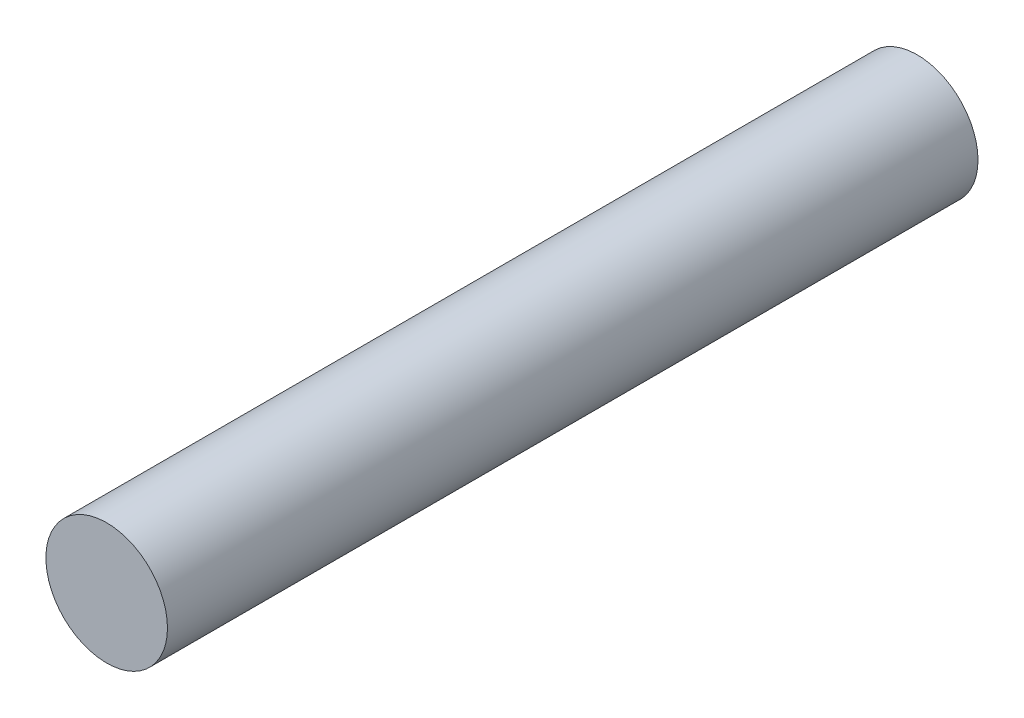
from build123d import *

# Parameters (mm, degrees)
SKETCH1_R           = 30
BOSS_EXTRUDE1_DEPTH = 400


with BuildPart() as part:
    # Sketch1 → Boss-Extrude1 (new body)
    with BuildSketch(Plane.XY):
        Circle(SKETCH1_R)
    extrude(amount=-BOSS_EXTRUDE1_DEPTH)


solid = part.part
